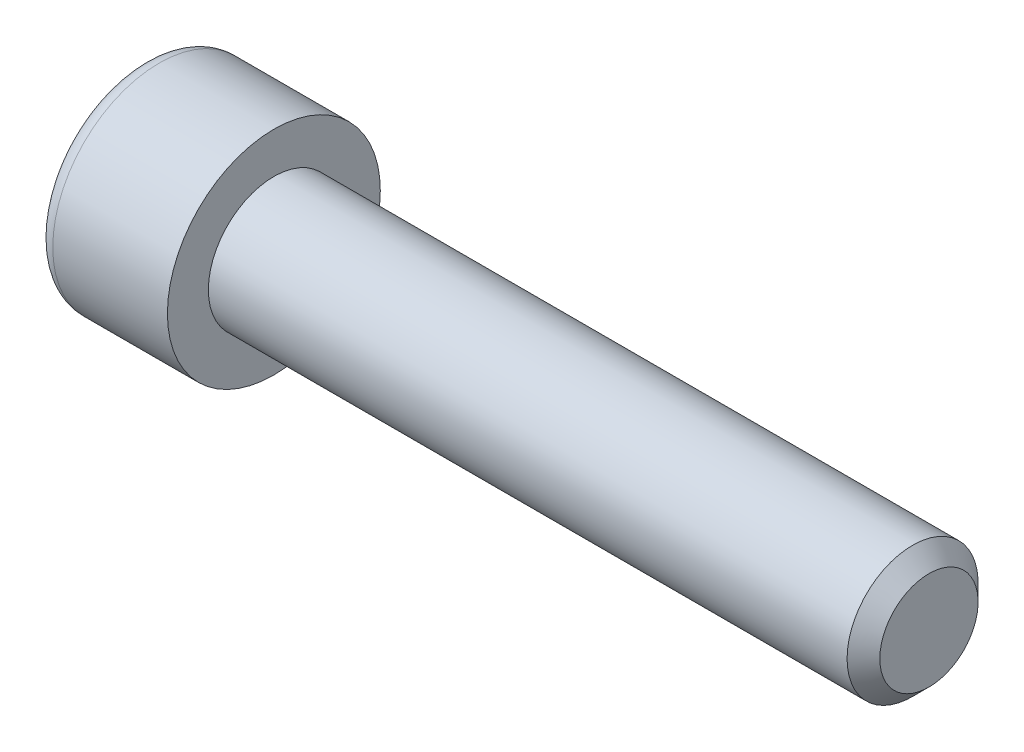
from build123d import *

# Parameters (mm, degrees)
ENL_V_MAT_EXTRU_1_DEPTH = 4


with BuildPart() as part:
    # Esquisse1 → Base-R_volution (revolve)
    with BuildSketch(Plane.XY, mode=Mode.PRIVATE) as base_r_volution_sk:
        with BuildLine():
            Line((-8, 0), (-8, 5.5))
            ThreePointArc((-8, 5.5), (-7.707106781, 6.207106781), (-7, 6.5))
            Line((-7, 6.5), (0, 6.5))
            Line((0, 6.5), (0, 4))
            Line((0, 4), (39, 4))
            Line((39, 4), (40, 3))
            Line((40, 3), (40, 0))
            Line((40, 0), (-8, 0))
        make_face()
    revolve(base_r_volution_sk.sketch.rotate(Axis((-28.576196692, 0, 0), (1, 0, 0)), 90), axis=Axis((-28.576196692, 0, 0), (1, 0, 0)))

    # Esquisse2 → Enl_v. mat.-Extru.1 (cut)
    with BuildSketch(Plane(origin=(-8, 5.465458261, -1.391437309), x_dir=(0, 0, 1), z_dir=(-1, 0, 0))):
        Polygon((-0.340613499, -8.550065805), (-2.072664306, -5.550065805), (-0.340613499, -2.550065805), (3.123488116, -2.550065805), (4.855538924, -5.550065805), (3.123488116, -8.550065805), align=None)
    extrude(amount=-ENL_V_MAT_EXTRU_1_DEPTH, mode=Mode.SUBTRACT)


solid = part.part
